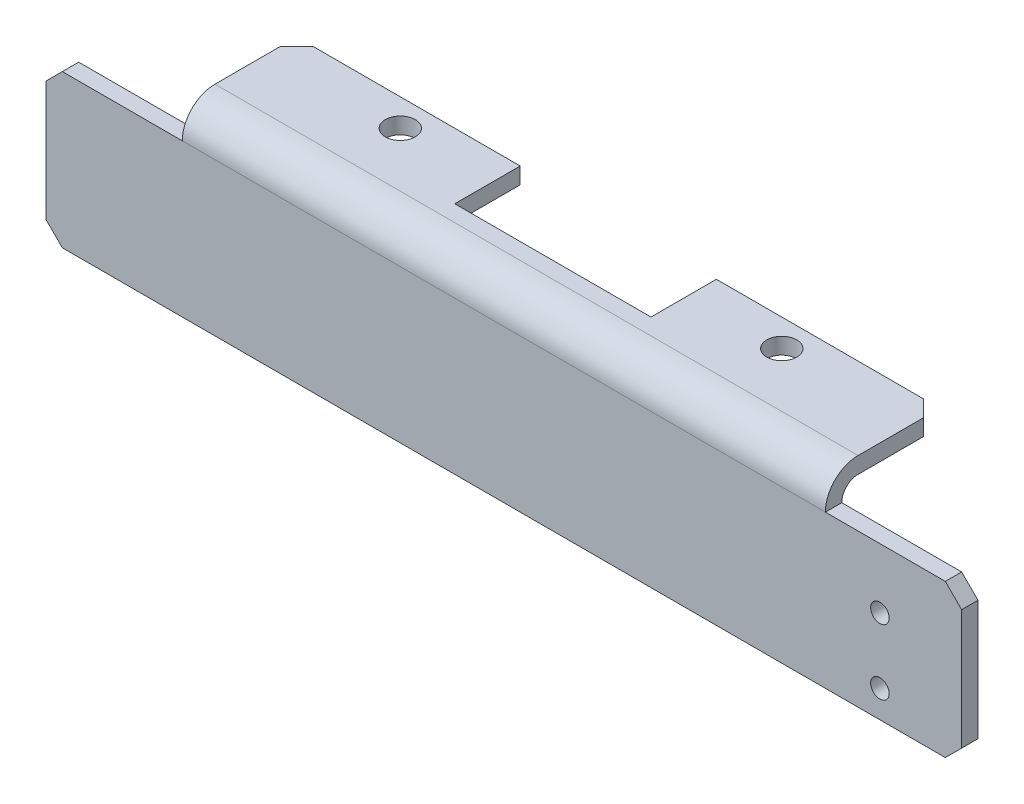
from build123d import *

# Parameters (mm, degrees)
EXTRUDE_1_DEPTH     = 168
SKETCH_2_W          = 25
SKETCH_2_H          = 21
CUT_EXTRUDE_1_DEPTH = 6
SKETCH_3_W          = 36
SKETCH_3_H          = 12
CUT_EXTRUDE_2_DEPTH = 6
SKETCH_4_R          = 2.75
CUT_EXTRUDE_3_DEPTH = 6
SKETCH_5_R          = 1.7
CUT_EXTRUDE_4_DEPTH = 6
CHAMFER_1_SIZE      = 3


with BuildPart() as part:
    # Sketch 1 → Extrude 1 (new body)
    with BuildSketch(Plane(origin=(0, 0, 0), x_dir=(0, 0, -1), z_dir=(1, 0, 0))):
        with BuildLine():
            Line((-3.372641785, 1.981486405), (-3.372641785, -26.018513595))
            Line((-3.372641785, -26.018513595), (-0.372641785, -26.018513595))
            Line((-0.372641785, -26.018513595), (-0.372641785, 1.981486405))
            ThreePointArc((-0.372641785, 1.981486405), (0.506037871, 4.102806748), (2.627358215, 4.981486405))
            Line((2.627358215, 4.981486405), (17.627358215, 4.981486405))
            Line((17.627358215, 4.981486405), (17.627358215, 7.981486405))
            Line((17.627358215, 7.981486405), (2.627358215, 7.981486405))
            ThreePointArc((2.627358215, 7.981486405), (-1.615282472, 6.224127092), (-3.372641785, 1.981486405))
        make_face()
    extrude(amount=EXTRUDE_1_DEPTH)

    # Sketch 2 → Cut-Extrude 1 (cut)
    with BuildSketch(Plane(origin=(0, 7.981486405, 0), x_dir=(1, 0, 0), z_dir=(0, 1, 0))):
        with Locations((155.5, 7.127358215)):
            Rectangle(SKETCH_2_W, SKETCH_2_H)
        with Locations((12.5, 7.127358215)):
            Rectangle(SKETCH_2_W, SKETCH_2_H)
    extrude(amount=-CUT_EXTRUDE_1_DEPTH, mode=Mode.SUBTRACT)

    # Sketch 3 → Cut-Extrude 2 (cut)
    with BuildSketch(Plane(origin=(0, 7.981486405, 0), x_dir=(1, 0, 0), z_dir=(0, 1, 0))):
        with Locations((84, 11.627358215)):
            Rectangle(SKETCH_3_W, SKETCH_3_H)
    extrude(amount=-CUT_EXTRUDE_2_DEPTH, mode=Mode.SUBTRACT)

    # Sketch 4 → Cut-Extrude 3 (cut)
    with BuildSketch(Plane(origin=(0, 7.981486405, 0), x_dir=(1, 0, 0), z_dir=(0, 1, 0))):
        with Locations(Location((49, 12.627358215, 0), (0, 0, 270))):
            Circle(SKETCH_4_R)
        with Locations(Location((119, 12.627358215, 0), (0, 0, 270))):
            Circle(SKETCH_4_R)
    extrude(amount=-CUT_EXTRUDE_3_DEPTH, mode=Mode.SUBTRACT)

    # Sketch 5 → Cut-Extrude 4 (cut)
    with BuildSketch(Plane.XY.offset(3.372641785)):
        with Locations((153, -21.018513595)):
            Circle(SKETCH_5_R)
        with Locations((153, -9.018513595)):
            Circle(SKETCH_5_R)
    extrude(amount=-CUT_EXTRUDE_4_DEPTH, mode=Mode.SUBTRACT)

    # Chamfer 1
    chamfer_1_edges = [part.edges().sort_by_distance(p)[0] for p in [
        (0, -26.018513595, 1.872641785),
        (0, 1.981486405, 1.872641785),
        (168, 1.981486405, 1.872641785),
        (143, 6.481486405, -17.627358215),
        (168, -26.018513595, 1.872641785),
        (25, 6.481486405, -17.627358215),
    ]]
    chamfer(chamfer_1_edges, length=CHAMFER_1_SIZE)


solid = part.part
